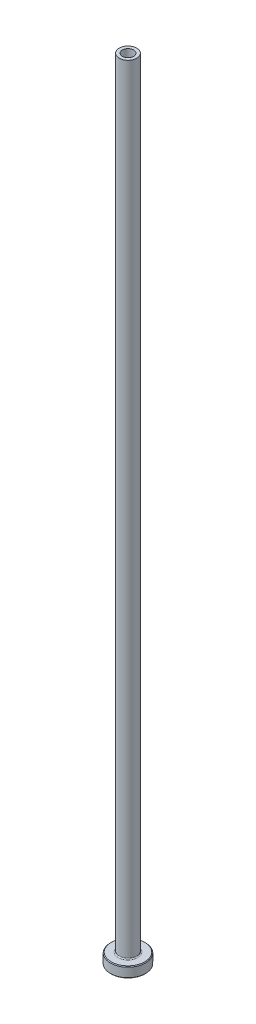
ISO-10303-21;
HEADER;
FILE_DESCRIPTION(('STEP AP214'),'2;1');
FILE_NAME('part.step','',(''),(''),'','','');
FILE_SCHEMA(('AUTOMOTIVE_DESIGN { 1 0 10303 214 1 1 1 1 }'));
ENDSEC;
DATA;
#1=APPLICATION_CONTEXT('core data for automotive mechanical design processes');
#2=APPLICATION_PROTOCOL_DEFINITION('international standard','automotive_design',2000,#1);
#3=PRODUCT_CONTEXT('',#1,'mechanical');
#4=PRODUCT('Part','Part','',(#3));
#5=PRODUCT_RELATED_PRODUCT_CATEGORY('part','',(#4));
#6=PRODUCT_DEFINITION_FORMATION('','',#4);
#7=PRODUCT_DEFINITION_CONTEXT('part definition',#1,'design');
#8=PRODUCT_DEFINITION('design','',#6,#7);
#9=PRODUCT_DEFINITION_SHAPE('','',#8);
#10=(LENGTH_UNIT() NAMED_UNIT(*) SI_UNIT(.MILLI.,.METRE.));
#11=(NAMED_UNIT(*) PLANE_ANGLE_UNIT() SI_UNIT($,.RADIAN.));
#12=(NAMED_UNIT(*) SI_UNIT($,.STERADIAN.) SOLID_ANGLE_UNIT());
#13=UNCERTAINTY_MEASURE_WITH_UNIT(LENGTH_MEASURE(1.E-05),#10,'distance_accuracy_value','');
#14=(GEOMETRIC_REPRESENTATION_CONTEXT(3) GLOBAL_UNCERTAINTY_ASSIGNED_CONTEXT((#13)) GLOBAL_UNIT_ASSIGNED_CONTEXT((#10,
#11,#12)) REPRESENTATION_CONTEXT('',''));
#15=CARTESIAN_POINT('',(0.,0.,0.));
#16=DIRECTION('',(0.,0.,1.));
#17=DIRECTION('',(1.,0.,0.));
#18=AXIS2_PLACEMENT_3D('',#15,#16,#17);
#19=CARTESIAN_POINT('',(0.,92.1876809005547,0.));
#20=DIRECTION('',(0.,1.,0.));
#21=DIRECTION('',(0.,0.,1.));
#22=AXIS2_PLACEMENT_3D('',#19,#20,#21);
#23=CYLINDRICAL_SURFACE('',#22,1.60000000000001);
#24=CARTESIAN_POINT('',(0.,225.,0.));
#25=DIRECTION('',(0.,1.,0.));
#26=DIRECTION('',(0.,0.,1.));
#27=AXIS2_PLACEMENT_3D('',#24,#25,#26);
#28=CIRCLE('',#27,1.60000000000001);
#29=CARTESIAN_POINT('',(0.,225.,1.60000000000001));
#30=VERTEX_POINT('',#29);
#31=EDGE_CURVE('E62',#30,#30,#28,.T.);
#32=ORIENTED_EDGE('',*,*,#31,.T.);
#33=EDGE_LOOP('',(#32));
#34=FACE_BOUND('',#33,.T.);
#35=CARTESIAN_POINT('',(0.,180.,0.));
#36=DIRECTION('',(0.,1.,0.));
#37=DIRECTION('',(0.,0.,1.));
#38=AXIS2_PLACEMENT_3D('',#35,#36,#37);
#39=CIRCLE('',#38,1.60000000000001);
#40=CARTESIAN_POINT('',(0.,180.,1.60000000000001));
#41=VERTEX_POINT('',#40);
#42=EDGE_CURVE('E71',#41,#41,#39,.T.);
#43=ORIENTED_EDGE('',*,*,#42,.F.);
#44=EDGE_LOOP('',(#43));
#45=FACE_BOUND('',#44,.T.);
#46=ADVANCED_FACE('F30',(#34,#45),#23,.F.);
#47=CARTESIAN_POINT('',(-1.60000000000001,225.,0.));
#48=DIRECTION('',(0.,1.,0.));
#49=DIRECTION('',(0.,0.,1.));
#50=AXIS2_PLACEMENT_3D('',#47,#48,#49);
#51=PLANE('',#50);
#52=CARTESIAN_POINT('',(0.,225.,0.));
#53=DIRECTION('',(0.,1.,0.));
#54=DIRECTION('',(0.,0.,1.));
#55=AXIS2_PLACEMENT_3D('',#52,#53,#54);
#56=CIRCLE('',#55,2.50000000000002);
#57=CARTESIAN_POINT('',(0.,225.,2.50000000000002));
#58=VERTEX_POINT('',#57);
#59=EDGE_CURVE('E65',#58,#58,#56,.T.);
#60=ORIENTED_EDGE('',*,*,#59,.T.);
#61=EDGE_LOOP('',(#60));
#62=FACE_BOUND('',#61,.T.);
#63=ORIENTED_EDGE('',*,*,#31,.F.);
#64=EDGE_LOOP('',(#63));
#65=FACE_BOUND('',#64,.T.);
#66=ADVANCED_FACE('F79',(#62,#65),#51,.T.);
#67=CARTESIAN_POINT('',(0.,92.1876809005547,0.));
#68=DIRECTION('',(0.,1.,0.));
#69=DIRECTION('',(0.,0.,1.));
#70=AXIS2_PLACEMENT_3D('',#67,#68,#69);
#71=CYLINDRICAL_SURFACE('',#70,2.5);
#72=CARTESIAN_POINT('',(0.,3.3,0.));
#73=DIRECTION('',(0.,1.,0.));
#74=DIRECTION('',(0.,0.,1.));
#75=AXIS2_PLACEMENT_3D('',#72,#73,#74);
#76=CIRCLE('',#75,2.5);
#77=CARTESIAN_POINT('',(0.,3.3,2.5));
#78=VERTEX_POINT('',#77);
#79=EDGE_CURVE('E59',#78,#78,#76,.T.);
#80=ORIENTED_EDGE('',*,*,#79,.T.);
#81=EDGE_LOOP('',(#80));
#82=FACE_BOUND('',#81,.T.);
#83=ORIENTED_EDGE('',*,*,#59,.F.);
#84=EDGE_LOOP('',(#83));
#85=FACE_BOUND('',#84,.T.);
#86=ADVANCED_FACE('F85',(#82,#85),#71,.T.);
#87=CARTESIAN_POINT('',(-2.49999999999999,3.,0.));
#88=DIRECTION('',(0.,1.,0.));
#89=DIRECTION('',(0.,0.,1.));
#90=AXIS2_PLACEMENT_3D('',#87,#88,#89);
#91=PLANE('',#90);
#92=CARTESIAN_POINT('',(0.,3.,0.));
#93=DIRECTION('',(0.,1.,0.));
#94=DIRECTION('',(0.,0.,1.));
#95=AXIS2_PLACEMENT_3D('',#92,#93,#94);
#96=CIRCLE('',#95,4.79999999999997);
#97=CARTESIAN_POINT('',(0.,3.,4.79999999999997));
#98=VERTEX_POINT('',#97);
#99=EDGE_CURVE('E53',#98,#98,#96,.T.);
#100=ORIENTED_EDGE('',*,*,#99,.T.);
#101=EDGE_LOOP('',(#100));
#102=FACE_BOUND('',#101,.T.);
#103=CARTESIAN_POINT('',(0.,3.,0.));
#104=DIRECTION('',(0.,1.,0.));
#105=DIRECTION('',(0.,0.,1.));
#106=AXIS2_PLACEMENT_3D('',#103,#104,#105);
#107=CIRCLE('',#106,2.8);
#108=CARTESIAN_POINT('',(0.,3.,2.8));
#109=VERTEX_POINT('',#108);
#110=EDGE_CURVE('E56',#109,#109,#107,.F.);
#111=ORIENTED_EDGE('',*,*,#110,.T.);
#112=EDGE_LOOP('',(#111));
#113=FACE_BOUND('',#112,.T.);
#114=ADVANCED_FACE('F111',(#102,#113),#91,.T.);
#115=CARTESIAN_POINT('',(0.,92.1876809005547,0.));
#116=DIRECTION('',(0.,1.,0.));
#117=DIRECTION('',(0.,0.,1.));
#118=AXIS2_PLACEMENT_3D('',#115,#116,#117);
#119=CYLINDRICAL_SURFACE('',#118,4.99999999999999);
#120=CARTESIAN_POINT('',(0.,2.79999999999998,0.));
#121=DIRECTION('',(0.,1.,0.));
#122=DIRECTION('',(0.,0.,1.));
#123=AXIS2_PLACEMENT_3D('',#120,#121,#122);
#124=CIRCLE('',#123,4.99999999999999);
#125=CARTESIAN_POINT('',(0.,2.79999999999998,4.99999999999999));
#126=VERTEX_POINT('',#125);
#127=EDGE_CURVE('E45',#126,#126,#124,.F.);
#128=ORIENTED_EDGE('',*,*,#127,.T.);
#129=EDGE_LOOP('',(#128));
#130=FACE_BOUND('',#129,.T.);
#131=CARTESIAN_POINT('',(0.,0.200000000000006,0.));
#132=DIRECTION('',(0.,-1.,0.));
#133=DIRECTION('',(0.,0.,-1.));
#134=AXIS2_PLACEMENT_3D('',#131,#132,#133);
#135=CIRCLE('',#134,4.99999999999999);
#136=CARTESIAN_POINT('',(0.,0.200000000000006,-4.99999999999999));
#137=VERTEX_POINT('',#136);
#138=EDGE_CURVE('E50',#137,#137,#135,.F.);
#139=ORIENTED_EDGE('',*,*,#138,.T.);
#140=EDGE_LOOP('',(#139));
#141=FACE_BOUND('',#140,.T.);
#142=ADVANCED_FACE('F108',(#130,#141),#119,.T.);
#143=CARTESIAN_POINT('',(-4.99999999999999,0.,0.));
#144=DIRECTION('',(0.,-1.,0.));
#145=DIRECTION('',(0.,0.,-1.));
#146=AXIS2_PLACEMENT_3D('',#143,#144,#145);
#147=PLANE('',#146);
#148=CARTESIAN_POINT('',(0.,0.,0.));
#149=DIRECTION('',(0.,-1.,0.));
#150=DIRECTION('',(0.,0.,-1.));
#151=AXIS2_PLACEMENT_3D('',#148,#149,#150);
#152=CIRCLE('',#151,2.34999999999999);
#153=CARTESIAN_POINT('',(0.,0.,-2.34999999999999));
#154=VERTEX_POINT('',#153);
#155=EDGE_CURVE('E37',#154,#154,#152,.F.);
#156=ORIENTED_EDGE('',*,*,#155,.T.);
#157=EDGE_LOOP('',(#156));
#158=FACE_BOUND('',#157,.T.);
#159=CARTESIAN_POINT('',(0.,0.,0.));
#160=DIRECTION('',(0.,-1.,0.));
#161=DIRECTION('',(0.,0.,-1.));
#162=AXIS2_PLACEMENT_3D('',#159,#160,#161);
#163=CIRCLE('',#162,4.8);
#164=CARTESIAN_POINT('',(0.,0.,-4.8));
#165=VERTEX_POINT('',#164);
#166=EDGE_CURVE('E41',#165,#165,#163,.T.);
#167=ORIENTED_EDGE('',*,*,#166,.T.);
#168=EDGE_LOOP('',(#167));
#169=FACE_BOUND('',#168,.T.);
#170=ADVANCED_FACE('F110',(#158,#169),#147,.T.);
#171=CARTESIAN_POINT('',(0.,92.1876809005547,0.));
#172=DIRECTION('',(0.,1.,0.));
#173=DIRECTION('',(0.,0.,1.));
#174=AXIS2_PLACEMENT_3D('',#171,#172,#173);
#175=CYLINDRICAL_SURFACE('',#174,1.85);
#176=CARTESIAN_POINT('',(0.,0.500000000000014,0.));
#177=DIRECTION('',(0.,-1.,0.));
#178=DIRECTION('',(0.,0.,-1.));
#179=AXIS2_PLACEMENT_3D('',#176,#177,#178);
#180=CIRCLE('',#179,1.85);
#181=CARTESIAN_POINT('',(0.,0.500000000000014,-1.85));
#182=VERTEX_POINT('',#181);
#183=EDGE_CURVE('E10',#182,#182,#180,.T.);
#184=ORIENTED_EDGE('',*,*,#183,.T.);
#185=EDGE_LOOP('',(#184));
#186=FACE_BOUND('',#185,.T.);
#187=CARTESIAN_POINT('',(0.,168.,0.));
#188=DIRECTION('',(0.,1.,0.));
#189=DIRECTION('',(0.,0.,1.));
#190=AXIS2_PLACEMENT_3D('',#187,#188,#189);
#191=CIRCLE('',#190,1.85000000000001);
#192=CARTESIAN_POINT('',(0.,168.,1.85000000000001));
#193=VERTEX_POINT('',#192);
#194=EDGE_CURVE('E68',#193,#193,#191,.T.);
#195=ORIENTED_EDGE('',*,*,#194,.T.);
#196=EDGE_LOOP('',(#195));
#197=FACE_BOUND('',#196,.T.);
#198=ADVANCED_FACE('F118',(#186,#197),#175,.F.);
#199=CARTESIAN_POINT('',(0.,168.,0.));
#200=DIRECTION('',(0.,-1.,0.));
#201=DIRECTION('',(0.,0.,-1.));
#202=AXIS2_PLACEMENT_3D('',#199,#200,#201);
#203=CONICAL_SURFACE('',#202,1.85000000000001,0.0208303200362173);
#204=ORIENTED_EDGE('',*,*,#42,.T.);
#205=EDGE_LOOP('',(#204));
#206=FACE_BOUND('',#205,.T.);
#207=ORIENTED_EDGE('',*,*,#194,.F.);
#208=EDGE_LOOP('',(#207));
#209=FACE_BOUND('',#208,.T.);
#210=ADVANCED_FACE('F75',(#206,#209),#203,.F.);
#211=CARTESIAN_POINT('',(0.,3.3,0.));
#212=DIRECTION('',(0.,1.,0.));
#213=DIRECTION('',(0.,0.,1.));
#214=AXIS2_PLACEMENT_3D('',#211,#212,#213);
#215=TOROIDAL_SURFACE('',#214,2.8,0.3);
#216=ORIENTED_EDGE('',*,*,#110,.F.);
#217=EDGE_LOOP('',(#216));
#218=FACE_BOUND('',#217,.T.);
#219=ORIENTED_EDGE('',*,*,#79,.F.);
#220=EDGE_LOOP('',(#219));
#221=FACE_BOUND('',#220,.T.);
#222=ADVANCED_FACE('F90',(#218,#221),#215,.F.);
#223=CARTESIAN_POINT('',(0.,3.,0.));
#224=DIRECTION('',(0.,-1.,0.));
#225=DIRECTION('',(0.,0.,-1.));
#226=AXIS2_PLACEMENT_3D('',#223,#224,#225);
#227=CONICAL_SURFACE('',#226,4.79999999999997,0.785398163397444);
#228=ORIENTED_EDGE('',*,*,#127,.F.);
#229=EDGE_LOOP('',(#228));
#230=FACE_BOUND('',#229,.T.);
#231=ORIENTED_EDGE('',*,*,#99,.F.);
#232=EDGE_LOOP('',(#231));
#233=FACE_BOUND('',#232,.T.);
#234=ADVANCED_FACE('F93',(#230,#233),#227,.T.);
#235=CARTESIAN_POINT('',(0.,0.200000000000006,0.));
#236=DIRECTION('',(0.,1.,0.));
#237=DIRECTION('',(0.,0.,1.));
#238=AXIS2_PLACEMENT_3D('',#235,#236,#237);
#239=CONICAL_SURFACE('',#238,4.99999999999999,0.785398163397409);
#240=ORIENTED_EDGE('',*,*,#166,.F.);
#241=EDGE_LOOP('',(#240));
#242=FACE_BOUND('',#241,.T.);
#243=ORIENTED_EDGE('',*,*,#138,.F.);
#244=EDGE_LOOP('',(#243));
#245=FACE_BOUND('',#244,.T.);
#246=ADVANCED_FACE('F96',(#242,#245),#239,.T.);
#247=CARTESIAN_POINT('',(0.,0.,0.));
#248=DIRECTION('',(0.,-1.,0.));
#249=DIRECTION('',(0.,0.,-1.));
#250=AXIS2_PLACEMENT_3D('',#247,#248,#249);
#251=CONICAL_SURFACE('',#250,2.34999999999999,0.785398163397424);
#252=ORIENTED_EDGE('',*,*,#183,.F.);
#253=EDGE_LOOP('',(#252));
#254=FACE_BOUND('',#253,.T.);
#255=ORIENTED_EDGE('',*,*,#155,.F.);
#256=EDGE_LOOP('',(#255));
#257=FACE_BOUND('',#256,.T.);
#258=ADVANCED_FACE('F32',(#254,#257),#251,.F.);
#259=CLOSED_SHELL('',(#46,#66,#86,#114,#142,#170,#198,#210,#222,#234,#246,#258));
#260=MANIFOLD_SOLID_BREP('B2',#259);
#261=ADVANCED_BREP_SHAPE_REPRESENTATION('',(#18,#260),#14);
#262=SHAPE_DEFINITION_REPRESENTATION(#9,#261);
ENDSEC;
END-ISO-10303-21;
